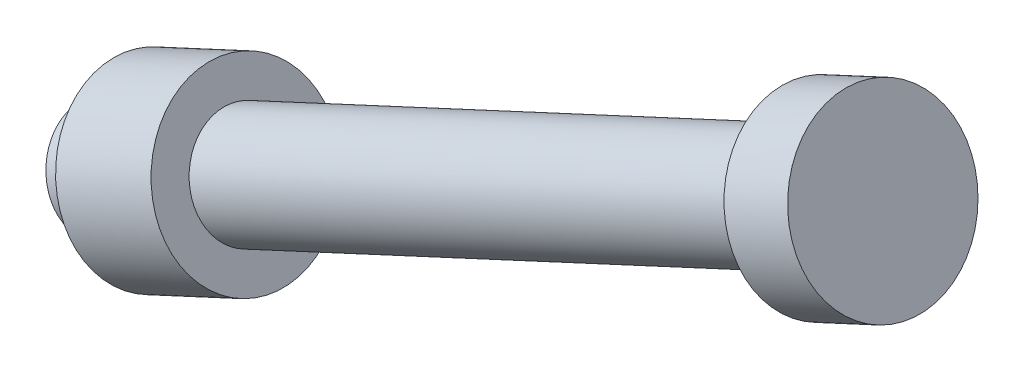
from build123d import *

# Parameters (mm, degrees)
CABEZA_PROFILE_R  = 5
VASTAGO_PROFILE_R = 3
TUERCA_PROFILE_R  = 5


with BuildPart() as part:
    # Cabeza: sweep along a curve in space
    with BuildLine() as cabeza_path:
        Line((436.593406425, 392.886366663, 0), (440.221707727, 394.570240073, 0))
    # Cabeza profile (on start of the path) → Cabeza (sweep)
    with BuildSketch(Plane(origin=(436.593406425, 392.886366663, 0), x_dir=(-0.42096835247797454, 0.907075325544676, 0), z_dir=(0.907075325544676, 0.42096835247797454, 0))):
        Circle(CABEZA_PROFILE_R)
    sweep(path=cabeza_path.line)

    # Vastago: sweep along a curve in space
    with BuildLine() as vastago_path:
        Line((395.775016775, 373.942790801, 0), (436.593406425, 392.886366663, 0))
    # Vastago profile (on start of the path) → Vastago (sweep)
    with BuildSketch(Plane(origin=(395.775016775, 373.942790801, 0), x_dir=(-0.4209683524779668, 0.9070753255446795, 0), z_dir=(0.9070753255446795, 0.4209683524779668, 0))):
        Circle(VASTAGO_PROFILE_R)
    sweep(path=vastago_path.line)

    # Tuerca: sweep along a curve in space
    with BuildLine() as tuerca_path:
        Line((398.496242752, 375.205695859, 0), (403.938694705, 377.731505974, 0))
    # Tuerca profile (on start of the path) → Tuerca (sweep)
    with BuildSketch(Plane(origin=(398.496242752, 375.205695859, 0), x_dir=(-0.420968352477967, 0.9070753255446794, 0), z_dir=(0.9070753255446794, 0.420968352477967, 0))):
        Circle(TUERCA_PROFILE_R)
    sweep(path=tuerca_path.line)


solid = part.part
